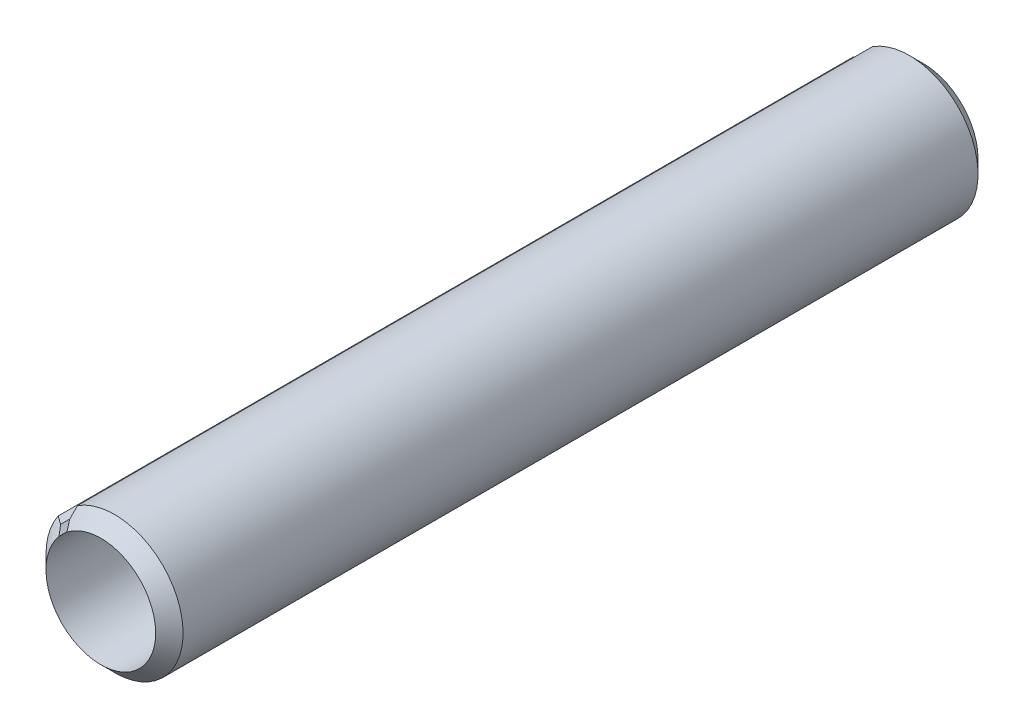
ISO-10303-21;
HEADER;
FILE_DESCRIPTION(('STEP AP214'),'2;1');
FILE_NAME('part.step','',(''),(''),'','','');
FILE_SCHEMA(('AUTOMOTIVE_DESIGN { 1 0 10303 214 1 1 1 1 }'));
ENDSEC;
DATA;
#1=APPLICATION_CONTEXT('core data for automotive mechanical design processes');
#2=APPLICATION_PROTOCOL_DEFINITION('international standard','automotive_design',2000,#1);
#3=PRODUCT_CONTEXT('',#1,'mechanical');
#4=PRODUCT('Part','Part','',(#3));
#5=PRODUCT_RELATED_PRODUCT_CATEGORY('part','',(#4));
#6=PRODUCT_DEFINITION_FORMATION('','',#4);
#7=PRODUCT_DEFINITION_CONTEXT('part definition',#1,'design');
#8=PRODUCT_DEFINITION('design','',#6,#7);
#9=PRODUCT_DEFINITION_SHAPE('','',#8);
#10=(LENGTH_UNIT() NAMED_UNIT(*) SI_UNIT(.MILLI.,.METRE.));
#11=(NAMED_UNIT(*) PLANE_ANGLE_UNIT() SI_UNIT($,.RADIAN.));
#12=(NAMED_UNIT(*) SI_UNIT($,.STERADIAN.) SOLID_ANGLE_UNIT());
#13=UNCERTAINTY_MEASURE_WITH_UNIT(LENGTH_MEASURE(1.E-05),#10,'distance_accuracy_value','');
#14=(GEOMETRIC_REPRESENTATION_CONTEXT(3) GLOBAL_UNCERTAINTY_ASSIGNED_CONTEXT((#13)) GLOBAL_UNIT_ASSIGNED_CONTEXT((#10,
#11,#12)) REPRESENTATION_CONTEXT('',''));
#15=CARTESIAN_POINT('',(0.,0.,0.));
#16=DIRECTION('',(0.,0.,1.));
#17=DIRECTION('',(1.,0.,0.));
#18=AXIS2_PLACEMENT_3D('',#15,#16,#17);
#19=CARTESIAN_POINT('',(0.,0.,6.));
#20=DIRECTION('',(0.,0.,-1.));
#21=DIRECTION('',(-1.,0.,0.));
#22=AXIS2_PLACEMENT_3D('',#19,#20,#21);
#23=CYLINDRICAL_SURFACE('',#22,0.4);
#24=CARTESIAN_POINT('',(0.,0.,0.));
#25=DIRECTION('',(0.,0.,-1.));
#26=DIRECTION('',(-1.,0.,0.));
#27=AXIS2_PLACEMENT_3D('',#24,#25,#26);
#28=CIRCLE('',#27,0.4);
#29=CARTESIAN_POINT('',(-0.247154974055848,0.314506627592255,0.));
#30=VERTEX_POINT('',#29);
#31=CARTESIAN_POINT('',(-0.305186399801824,0.258575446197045,0.));
#32=VERTEX_POINT('',#31);
#33=EDGE_CURVE('E109',#30,#32,#28,.T.);
#34=ORIENTED_EDGE('',*,*,#33,.T.);
#35=DIRECTION('',(0.,0.,-1.));
#36=VECTOR('',#35,1.);
#37=CARTESIAN_POINT('',(-0.305186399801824,0.258575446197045,6.));
#38=LINE('',#37,#36);
#39=CARTESIAN_POINT('',(-0.305186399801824,0.258575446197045,6.));
#40=VERTEX_POINT('',#39);
#41=EDGE_CURVE('E93',#40,#32,#38,.T.);
#42=ORIENTED_EDGE('',*,*,#41,.F.);
#43=CARTESIAN_POINT('',(0.,0.,6.));
#44=DIRECTION('',(0.,0.,-1.));
#45=DIRECTION('',(-1.,0.,0.));
#46=AXIS2_PLACEMENT_3D('',#43,#44,#45);
#47=CIRCLE('',#46,0.4);
#48=CARTESIAN_POINT('',(-0.247154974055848,0.314506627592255,6.));
#49=VERTEX_POINT('',#48);
#50=EDGE_CURVE('E107',#49,#40,#47,.T.);
#51=ORIENTED_EDGE('',*,*,#50,.F.);
#52=DIRECTION('',(0.,0.,-1.));
#53=VECTOR('',#52,1.);
#54=CARTESIAN_POINT('',(-0.247154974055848,0.314506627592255,6.));
#55=LINE('',#54,#53);
#56=EDGE_CURVE('E112',#49,#30,#55,.T.);
#57=ORIENTED_EDGE('',*,*,#56,.T.);
#58=EDGE_LOOP('',(#34,#42,#51,#57));
#59=FACE_BOUND('',#58,.T.);
#60=ADVANCED_FACE('F33',(#59),#23,.F.);
#61=CARTESIAN_POINT('',(-0.38148299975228,0.323219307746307,6.));
#62=DIRECTION('',(-0.646438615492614,-0.76296599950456,0.));
#63=DIRECTION('',(0.76296599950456,-0.646438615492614,0.));
#64=AXIS2_PLACEMENT_3D('',#61,#62,#63);
#65=PLANE('',#64);
#66=DIRECTION('',(0.539498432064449,-0.457101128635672,-0.707106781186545));
#67=VECTOR('',#66,1.);
#68=CARTESIAN_POINT('',(0.,0.,-0.399999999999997));
#69=LINE('',#68,#67);
#70=CARTESIAN_POINT('',(-0.343334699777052,0.290897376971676,0.049999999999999));
#71=VERTEX_POINT('',#70);
#72=EDGE_CURVE('E126',#32,#71,#69,.F.);
#73=ORIENTED_EDGE('',*,*,#72,.T.);
#74=DIRECTION('',(0.,0.,1.));
#75=VECTOR('',#74,1.);
#76=CARTESIAN_POINT('',(-0.343334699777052,0.290897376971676,6.));
#77=LINE('',#76,#75);
#78=CARTESIAN_POINT('',(-0.343334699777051,0.290897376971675,5.95));
#79=VERTEX_POINT('',#78);
#80=EDGE_CURVE('E96',#71,#79,#77,.T.);
#81=ORIENTED_EDGE('',*,*,#80,.T.);
#82=DIRECTION('',(-0.539498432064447,0.457101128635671,-0.707106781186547));
#83=VECTOR('',#82,1.);
#84=CARTESIAN_POINT('',(0.,0.,6.4));
#85=LINE('',#84,#83);
#86=EDGE_CURVE('E89',#79,#40,#85,.F.);
#87=ORIENTED_EDGE('',*,*,#86,.T.);
#88=ORIENTED_EDGE('',*,*,#41,.T.);
#89=EDGE_LOOP('',(#73,#81,#87,#88));
#90=FACE_BOUND('',#89,.T.);
#91=ADVANCED_FACE('F92',(#90),#65,.F.);
#92=CARTESIAN_POINT('',(0.,0.,6.));
#93=DIRECTION('',(0.,0.,-1.));
#94=DIRECTION('',(-1.,0.,0.));
#95=AXIS2_PLACEMENT_3D('',#92,#93,#94);
#96=CYLINDRICAL_SURFACE('',#95,0.5);
#97=CARTESIAN_POINT('',(0.,0.,0.0999999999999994));
#98=DIRECTION('',(0.,0.,-1.));
#99=DIRECTION('',(-1.,0.,0.));
#100=AXIS2_PLACEMENT_3D('',#97,#98,#99);
#101=CIRCLE('',#100,0.5);
#102=CARTESIAN_POINT('',(-0.410588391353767,0.285336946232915,0.0999999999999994));
#103=VERTEX_POINT('',#102);
#104=CARTESIAN_POINT('',(-0.270014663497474,0.420823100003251,0.0999999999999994));
#105=VERTEX_POINT('',#104);
#106=EDGE_CURVE('E101',#103,#105,#101,.F.);
#107=ORIENTED_EDGE('',*,*,#106,.T.);
#108=DIRECTION('',(0.,0.,-1.));
#109=VECTOR('',#108,1.);
#110=CARTESIAN_POINT('',(-0.270014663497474,0.420823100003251,6.));
#111=LINE('',#110,#109);
#112=CARTESIAN_POINT('',(-0.270014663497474,0.420823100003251,5.9));
#113=VERTEX_POINT('',#112);
#114=EDGE_CURVE('E46',#105,#113,#111,.F.);
#115=ORIENTED_EDGE('',*,*,#114,.T.);
#116=CARTESIAN_POINT('',(0.,0.,5.9));
#117=DIRECTION('',(0.,0.,-1.));
#118=DIRECTION('',(-1.,0.,0.));
#119=AXIS2_PLACEMENT_3D('',#116,#117,#118);
#120=CIRCLE('',#119,0.5);
#121=CARTESIAN_POINT('',(-0.410588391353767,0.285336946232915,5.9));
#122=VERTEX_POINT('',#121);
#123=EDGE_CURVE('E102',#113,#122,#120,.T.);
#124=ORIENTED_EDGE('',*,*,#123,.T.);
#125=DIRECTION('',(0.,0.,-1.));
#126=VECTOR('',#125,1.);
#127=CARTESIAN_POINT('',(-0.410588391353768,0.285336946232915,6.));
#128=LINE('',#127,#126);
#129=EDGE_CURVE('E128',#122,#103,#128,.T.);
#130=ORIENTED_EDGE('',*,*,#129,.T.);
#131=EDGE_LOOP('',(#107,#115,#124,#130));
#132=FACE_BOUND('',#131,.T.);
#133=ADVANCED_FACE('F161',(#132),#96,.T.);
#134=CARTESIAN_POINT('',(-0.308943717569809,0.393133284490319,6.));
#135=DIRECTION('',(0.786266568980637,0.617887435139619,0.));
#136=DIRECTION('',(-0.617887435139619,0.786266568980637,0.));
#137=AXIS2_PLACEMENT_3D('',#134,#135,#136);
#138=PLANE('',#137);
#139=DIRECTION('',(0.436912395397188,-0.55597442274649,0.707106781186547));
#140=VECTOR('',#139,1.);
#141=CARTESIAN_POINT('',(0.,0.,6.4));
#142=LINE('',#141,#140);
#143=CARTESIAN_POINT('',(-0.278049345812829,0.353819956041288,5.95));
#144=VERTEX_POINT('',#143);
#145=EDGE_CURVE('E111',#49,#144,#142,.F.);
#146=ORIENTED_EDGE('',*,*,#145,.T.);
#147=DIRECTION('',(0.,0.,-1.));
#148=VECTOR('',#147,1.);
#149=CARTESIAN_POINT('',(-0.278049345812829,0.353819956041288,6.));
#150=LINE('',#149,#148);
#151=CARTESIAN_POINT('',(-0.278049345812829,0.353819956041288,0.0500000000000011));
#152=VERTEX_POINT('',#151);
#153=EDGE_CURVE('E150',#144,#152,#150,.T.);
#154=ORIENTED_EDGE('',*,*,#153,.T.);
#155=DIRECTION('',(-0.436912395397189,0.555974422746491,0.707106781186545));
#156=VECTOR('',#155,1.);
#157=CARTESIAN_POINT('',(0.,0.,-0.399999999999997));
#158=LINE('',#157,#156);
#159=EDGE_CURVE('E124',#152,#30,#158,.F.);
#160=ORIENTED_EDGE('',*,*,#159,.T.);
#161=ORIENTED_EDGE('',*,*,#56,.F.);
#162=EDGE_LOOP('',(#146,#154,#160,#161));
#163=FACE_BOUND('',#162,.T.);
#164=ADVANCED_FACE('F155',(#163),#138,.F.);
#165=CARTESIAN_POINT('',(0.,0.,6.));
#166=DIRECTION('',(0.,0.,-1.));
#167=DIRECTION('',(-1.,0.,0.));
#168=AXIS2_PLACEMENT_3D('',#165,#166,#167);
#169=CONICAL_SURFACE('',#168,0.399999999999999,0.785398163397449);
#170=ORIENTED_EDGE('',*,*,#123,.F.);
#171=CARTESIAN_POINT('',(-0.270014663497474,0.420823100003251,5.9));
#172=CARTESIAN_POINT('',(-0.271333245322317,0.409827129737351,5.90856594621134));
#173=CARTESIAN_POINT('',(-0.272662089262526,0.39874558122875,5.9170155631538));
#174=CARTESIAN_POINT('',(-0.275340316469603,0.376411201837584,5.93368223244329));
#175=CARTESIAN_POINT('',(-0.276689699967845,0.365158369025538,5.9418992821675));
#176=CARTESIAN_POINT('',(-0.278049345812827,0.353819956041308,5.95000000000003));
#177=B_SPLINE_CURVE_WITH_KNOTS('',3,(#171,#172,#173,#174,#175,#176),.UNSPECIFIED.,.F.,.F.,(4,2,
4),(0.,0.0419959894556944,0.0839924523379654),.UNSPECIFIED.);
#178=EDGE_CURVE('E11',#113,#144,#177,.T.);
#179=ORIENTED_EDGE('',*,*,#178,.T.);
#180=ORIENTED_EDGE('',*,*,#145,.F.);
#181=ORIENTED_EDGE('',*,*,#50,.T.);
#182=ORIENTED_EDGE('',*,*,#86,.F.);
#183=CARTESIAN_POINT('',(-0.343334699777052,0.290897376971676,5.95));
#184=CARTESIAN_POINT('',(-0.354715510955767,0.28995642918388,5.94189928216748));
#185=CARTESIAN_POINT('',(-0.366010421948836,0.289022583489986,5.93368223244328));
#186=CARTESIAN_POINT('',(-0.388428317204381,0.287169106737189,5.91701556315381));
#187=CARTESIAN_POINT('',(-0.399551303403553,0.286249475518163,5.90856594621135));
#188=CARTESIAN_POINT('',(-0.410588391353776,0.285336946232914,5.90000000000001));
#189=B_SPLINE_CURVE_WITH_KNOTS('',3,(#183,#184,#185,#186,#187,#188),.UNSPECIFIED.,.F.,.F.,(4,2,
4),(0.,0.0419964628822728,0.0839924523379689),.UNSPECIFIED.);
#190=EDGE_CURVE('E145',#79,#122,#189,.T.);
#191=ORIENTED_EDGE('',*,*,#190,.T.);
#192=EDGE_LOOP('',(#170,#179,#180,#181,#182,#191));
#193=FACE_BOUND('',#192,.T.);
#194=ADVANCED_FACE('F114',(#193),#169,.T.);
#195=CARTESIAN_POINT('',(0.,0.,0.0999999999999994));
#196=DIRECTION('',(0.,0.,1.));
#197=DIRECTION('',(1.,0.,0.));
#198=AXIS2_PLACEMENT_3D('',#195,#196,#197);
#199=CONICAL_SURFACE('',#198,0.5,0.785398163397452);
#200=ORIENTED_EDGE('',*,*,#159,.F.);
#201=CARTESIAN_POINT('',(-0.278049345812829,0.353819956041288,0.0500000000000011));
#202=CARTESIAN_POINT('',(-0.276689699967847,0.365158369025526,0.0581007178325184));
#203=CARTESIAN_POINT('',(-0.275340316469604,0.376411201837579,0.0663177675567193));
#204=CARTESIAN_POINT('',(-0.272662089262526,0.398745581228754,0.082984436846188));
#205=CARTESIAN_POINT('',(-0.271333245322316,0.409827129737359,0.0914340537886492));
#206=CARTESIAN_POINT('',(-0.270014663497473,0.420823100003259,0.0999999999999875));
#207=B_SPLINE_CURVE_WITH_KNOTS('',3,(#201,#202,#203,#204,#205,#206),.UNSPECIFIED.,.F.,.F.,(4,2,
4),(0.,0.041996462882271,0.0839924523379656),.UNSPECIFIED.);
#208=EDGE_CURVE('E60',#152,#105,#207,.T.);
#209=ORIENTED_EDGE('',*,*,#208,.T.);
#210=ORIENTED_EDGE('',*,*,#106,.F.);
#211=CARTESIAN_POINT('',(-0.410588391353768,0.285336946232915,0.0999999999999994));
#212=CARTESIAN_POINT('',(-0.399551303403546,0.286249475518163,0.0914340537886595));
#213=CARTESIAN_POINT('',(-0.388428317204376,0.287169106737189,0.082984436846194));
#214=CARTESIAN_POINT('',(-0.366010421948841,0.289022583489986,0.0663177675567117));
#215=CARTESIAN_POINT('',(-0.354715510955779,0.28995642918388,0.0581007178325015));
#216=CARTESIAN_POINT('',(-0.343334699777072,0.290897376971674,0.0499999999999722));
#217=B_SPLINE_CURVE_WITH_KNOTS('',3,(#211,#212,#213,#214,#215,#216),.UNSPECIFIED.,.F.,.F.,(4,2,
4),(0.,0.0419959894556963,0.0839924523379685),.UNSPECIFIED.);
#218=EDGE_CURVE('E131',#103,#71,#217,.T.);
#219=ORIENTED_EDGE('',*,*,#218,.T.);
#220=ORIENTED_EDGE('',*,*,#72,.F.);
#221=ORIENTED_EDGE('',*,*,#33,.F.);
#222=EDGE_LOOP('',(#200,#209,#210,#219,#220,#221));
#223=FACE_BOUND('',#222,.T.);
#224=ADVANCED_FACE('F138',(#223),#199,.T.);
#225=CARTESIAN_POINT('',(-0.410588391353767,0.285336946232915,6.));
#226=DIRECTION('',(0.0823973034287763,-0.996599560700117,0.));
#227=DIRECTION('',(0.,0.,-1.));
#228=AXIS2_PLACEMENT_3D('',#225,#226,#227);
#229=PLANE('',#228);
#230=ORIENTED_EDGE('',*,*,#190,.F.);
#231=ORIENTED_EDGE('',*,*,#80,.F.);
#232=ORIENTED_EDGE('',*,*,#218,.F.);
#233=ORIENTED_EDGE('',*,*,#129,.F.);
#234=EDGE_LOOP('',(#230,#231,#232,#233));
#235=FACE_BOUND('',#234,.T.);
#236=ADVANCED_FACE('F140',(#235),#229,.F.);
#237=CARTESIAN_POINT('',(-0.278049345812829,0.353819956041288,6.));
#238=DIRECTION('',(0.992886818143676,-0.119062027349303,0.));
#239=DIRECTION('',(0.,0.,-1.));
#240=AXIS2_PLACEMENT_3D('',#237,#238,#239);
#241=PLANE('',#240);
#242=ORIENTED_EDGE('',*,*,#178,.F.);
#243=ORIENTED_EDGE('',*,*,#114,.F.);
#244=ORIENTED_EDGE('',*,*,#208,.F.);
#245=ORIENTED_EDGE('',*,*,#153,.F.);
#246=EDGE_LOOP('',(#242,#243,#244,#245));
#247=FACE_BOUND('',#246,.T.);
#248=ADVANCED_FACE('F35',(#247),#241,.F.);
#249=CLOSED_SHELL('',(#60,#91,#133,#164,#194,#224,#236,#248));
#250=MANIFOLD_SOLID_BREP('B2',#249);
#251=ADVANCED_BREP_SHAPE_REPRESENTATION('',(#18,#250),#14);
#252=SHAPE_DEFINITION_REPRESENTATION(#9,#251);
ENDSEC;
END-ISO-10303-21;
